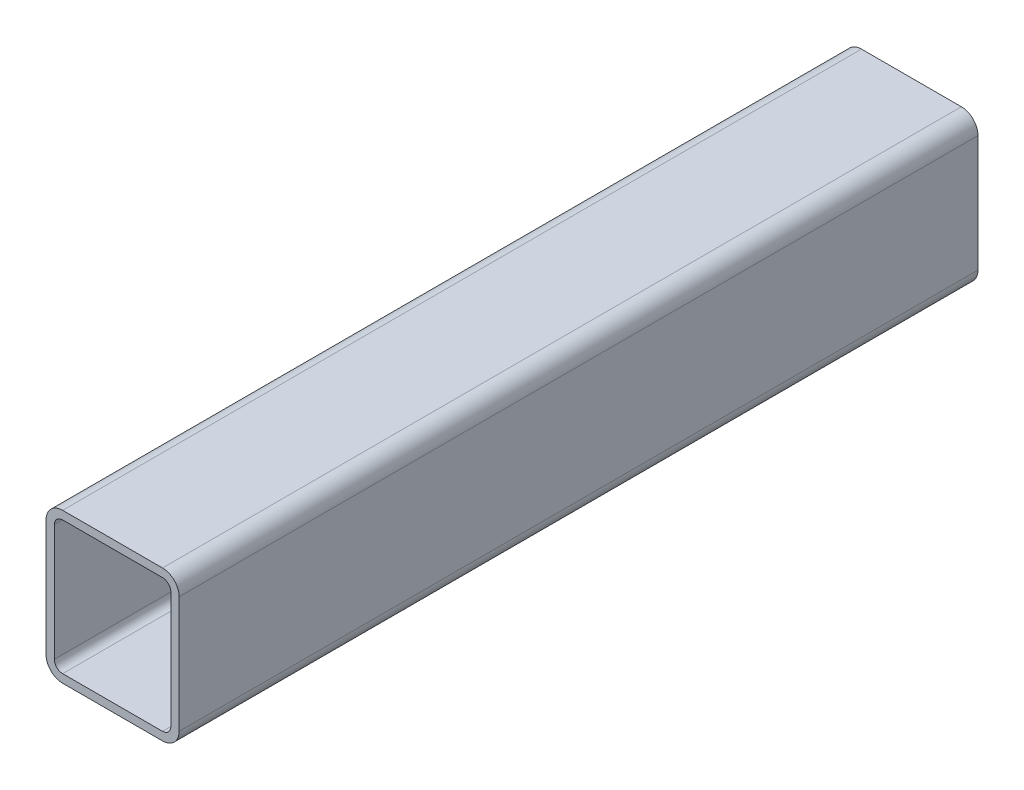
ISO-10303-21;
HEADER;
FILE_DESCRIPTION(('STEP AP214'),'2;1');
FILE_NAME('part.step','',(''),(''),'','','');
FILE_SCHEMA(('AUTOMOTIVE_DESIGN { 1 0 10303 214 1 1 1 1 }'));
ENDSEC;
DATA;
#1=APPLICATION_CONTEXT('core data for automotive mechanical design processes');
#2=APPLICATION_PROTOCOL_DEFINITION('international standard','automotive_design',2000,#1);
#3=PRODUCT_CONTEXT('',#1,'mechanical');
#4=PRODUCT('Part','Part','',(#3));
#5=PRODUCT_RELATED_PRODUCT_CATEGORY('part','',(#4));
#6=PRODUCT_DEFINITION_FORMATION('','',#4);
#7=PRODUCT_DEFINITION_CONTEXT('part definition',#1,'design');
#8=PRODUCT_DEFINITION('design','',#6,#7);
#9=PRODUCT_DEFINITION_SHAPE('','',#8);
#10=(LENGTH_UNIT() NAMED_UNIT(*) SI_UNIT(.MILLI.,.METRE.));
#11=(NAMED_UNIT(*) PLANE_ANGLE_UNIT() SI_UNIT($,.RADIAN.));
#12=(NAMED_UNIT(*) SI_UNIT($,.STERADIAN.) SOLID_ANGLE_UNIT());
#13=UNCERTAINTY_MEASURE_WITH_UNIT(LENGTH_MEASURE(1.E-05),#10,'distance_accuracy_value','');
#14=(GEOMETRIC_REPRESENTATION_CONTEXT(3) GLOBAL_UNCERTAINTY_ASSIGNED_CONTEXT((#13)) GLOBAL_UNIT_ASSIGNED_CONTEXT((#10,
#11,#12)) REPRESENTATION_CONTEXT('',''));
#15=CARTESIAN_POINT('',(0.,0.,0.));
#16=DIRECTION('',(0.,0.,1.));
#17=DIRECTION('',(1.,0.,0.));
#18=AXIS2_PLACEMENT_3D('',#15,#16,#17);
#19=CARTESIAN_POINT('',(6.35,50.8,304.8));
#20=DIRECTION('',(0.,0.,1.));
#21=DIRECTION('',(1.,0.,0.));
#22=AXIS2_PLACEMENT_3D('',#19,#20,#21);
#23=PLANE('',#22);
#24=CARTESIAN_POINT('',(6.35,50.8,304.8));
#25=DIRECTION('',(0.,0.,1.));
#26=DIRECTION('',(1.,0.,0.));
#27=AXIS2_PLACEMENT_3D('',#24,#25,#26);
#28=CIRCLE('',#27,6.35);
#29=CARTESIAN_POINT('',(6.35,57.15,304.8));
#30=VERTEX_POINT('',#29);
#31=CARTESIAN_POINT('',(0.,50.8,304.8));
#32=VERTEX_POINT('',#31);
#33=EDGE_CURVE('E211',#30,#32,#28,.T.);
#34=ORIENTED_EDGE('',*,*,#33,.T.);
#35=DIRECTION('',(0.,-1.,0.));
#36=VECTOR('',#35,1.);
#37=CARTESIAN_POINT('',(0.,6.35,304.8));
#38=LINE('',#37,#36);
#39=CARTESIAN_POINT('',(0.,6.35,304.8));
#40=VERTEX_POINT('',#39);
#41=EDGE_CURVE('E214',#32,#40,#38,.T.);
#42=ORIENTED_EDGE('',*,*,#41,.T.);
#43=CARTESIAN_POINT('',(6.35,6.35,304.8));
#44=DIRECTION('',(0.,0.,1.));
#45=DIRECTION('',(1.,0.,0.));
#46=AXIS2_PLACEMENT_3D('',#43,#44,#45);
#47=CIRCLE('',#46,6.35);
#48=CARTESIAN_POINT('',(6.35,0.,304.8));
#49=VERTEX_POINT('',#48);
#50=EDGE_CURVE('E217',#40,#49,#47,.T.);
#51=ORIENTED_EDGE('',*,*,#50,.T.);
#52=DIRECTION('',(1.,0.,0.));
#53=VECTOR('',#52,1.);
#54=CARTESIAN_POINT('',(44.4499999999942,0.,304.8));
#55=LINE('',#54,#53);
#56=CARTESIAN_POINT('',(44.4499999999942,0.,304.8));
#57=VERTEX_POINT('',#56);
#58=EDGE_CURVE('E219',#49,#57,#55,.T.);
#59=ORIENTED_EDGE('',*,*,#58,.T.);
#60=CARTESIAN_POINT('',(44.4499999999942,6.35,304.8));
#61=DIRECTION('',(0.,0.,1.));
#62=DIRECTION('',(1.,0.,0.));
#63=AXIS2_PLACEMENT_3D('',#60,#61,#62);
#64=CIRCLE('',#63,6.35);
#65=CARTESIAN_POINT('',(50.7999999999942,6.35,304.8));
#66=VERTEX_POINT('',#65);
#67=EDGE_CURVE('E221',#57,#66,#64,.T.);
#68=ORIENTED_EDGE('',*,*,#67,.T.);
#69=DIRECTION('',(0.,1.,0.));
#70=VECTOR('',#69,1.);
#71=CARTESIAN_POINT('',(50.7999999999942,50.8,304.8));
#72=LINE('',#71,#70);
#73=CARTESIAN_POINT('',(50.7999999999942,50.8,304.8));
#74=VERTEX_POINT('',#73);
#75=EDGE_CURVE('E223',#66,#74,#72,.T.);
#76=ORIENTED_EDGE('',*,*,#75,.T.);
#77=CARTESIAN_POINT('',(44.4499999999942,50.8,304.8));
#78=DIRECTION('',(0.,0.,1.));
#79=DIRECTION('',(1.,0.,0.));
#80=AXIS2_PLACEMENT_3D('',#77,#78,#79);
#81=CIRCLE('',#80,6.35);
#82=CARTESIAN_POINT('',(44.4499999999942,57.15,304.8));
#83=VERTEX_POINT('',#82);
#84=EDGE_CURVE('E225',#74,#83,#81,.T.);
#85=ORIENTED_EDGE('',*,*,#84,.T.);
#86=DIRECTION('',(-1.,0.,0.));
#87=VECTOR('',#86,1.);
#88=CARTESIAN_POINT('',(6.35,57.15,304.8));
#89=LINE('',#88,#87);
#90=EDGE_CURVE('E227',#83,#30,#89,.T.);
#91=ORIENTED_EDGE('',*,*,#90,.T.);
#92=EDGE_LOOP('',(#34,#42,#51,#59,#68,#76,#85,#91));
#93=FACE_BOUND('',#92,.T.);
#94=DIRECTION('',(0.,-1.,0.));
#95=VECTOR('',#94,1.);
#96=CARTESIAN_POINT('',(3.175,6.35,304.8));
#97=LINE('',#96,#95);
#98=CARTESIAN_POINT('',(3.175,50.8,304.8));
#99=VERTEX_POINT('',#98);
#100=CARTESIAN_POINT('',(3.175,6.35,304.8));
#101=VERTEX_POINT('',#100);
#102=EDGE_CURVE('E154',#99,#101,#97,.T.);
#103=ORIENTED_EDGE('',*,*,#102,.F.);
#104=CARTESIAN_POINT('',(6.35,50.8,304.8));
#105=DIRECTION('',(0.,0.,1.));
#106=DIRECTION('',(1.,0.,0.));
#107=AXIS2_PLACEMENT_3D('',#104,#105,#106);
#108=CIRCLE('',#107,3.175);
#109=CARTESIAN_POINT('',(6.35,53.975,304.8));
#110=VERTEX_POINT('',#109);
#111=EDGE_CURVE('E146',#110,#99,#108,.T.);
#112=ORIENTED_EDGE('',*,*,#111,.F.);
#113=DIRECTION('',(-1.,0.,0.));
#114=VECTOR('',#113,1.);
#115=CARTESIAN_POINT('',(6.35,53.975,304.8));
#116=LINE('',#115,#114);
#117=CARTESIAN_POINT('',(44.4499999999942,53.975,304.8));
#118=VERTEX_POINT('',#117);
#119=EDGE_CURVE('E179',#118,#110,#116,.T.);
#120=ORIENTED_EDGE('',*,*,#119,.F.);
#121=CARTESIAN_POINT('',(44.4499999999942,50.8,304.8));
#122=DIRECTION('',(0.,0.,1.));
#123=DIRECTION('',(1.,0.,0.));
#124=AXIS2_PLACEMENT_3D('',#121,#122,#123);
#125=CIRCLE('',#124,3.175);
#126=CARTESIAN_POINT('',(47.6249999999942,50.8,304.8));
#127=VERTEX_POINT('',#126);
#128=EDGE_CURVE('E177',#127,#118,#125,.T.);
#129=ORIENTED_EDGE('',*,*,#128,.F.);
#130=DIRECTION('',(0.,1.,0.));
#131=VECTOR('',#130,1.);
#132=CARTESIAN_POINT('',(47.6249999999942,50.8,304.8));
#133=LINE('',#132,#131);
#134=CARTESIAN_POINT('',(47.6249999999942,6.35,304.8));
#135=VERTEX_POINT('',#134);
#136=EDGE_CURVE('E175',#135,#127,#133,.T.);
#137=ORIENTED_EDGE('',*,*,#136,.F.);
#138=CARTESIAN_POINT('',(44.4499999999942,6.35,304.8));
#139=DIRECTION('',(0.,0.,1.));
#140=DIRECTION('',(1.,0.,0.));
#141=AXIS2_PLACEMENT_3D('',#138,#139,#140);
#142=CIRCLE('',#141,3.175);
#143=CARTESIAN_POINT('',(44.4499999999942,3.175,304.8));
#144=VERTEX_POINT('',#143);
#145=EDGE_CURVE('E173',#144,#135,#142,.T.);
#146=ORIENTED_EDGE('',*,*,#145,.F.);
#147=DIRECTION('',(1.,0.,0.));
#148=VECTOR('',#147,1.);
#149=CARTESIAN_POINT('',(44.4499999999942,3.175,304.8));
#150=LINE('',#149,#148);
#151=CARTESIAN_POINT('',(6.35,3.175,304.8));
#152=VERTEX_POINT('',#151);
#153=EDGE_CURVE('E169',#152,#144,#150,.T.);
#154=ORIENTED_EDGE('',*,*,#153,.F.);
#155=CARTESIAN_POINT('',(6.35,6.35,304.8));
#156=DIRECTION('',(0.,0.,1.));
#157=DIRECTION('',(1.,0.,0.));
#158=AXIS2_PLACEMENT_3D('',#155,#156,#157);
#159=CIRCLE('',#158,3.175);
#160=EDGE_CURVE('E167',#101,#152,#159,.T.);
#161=ORIENTED_EDGE('',*,*,#160,.F.);
#162=EDGE_LOOP('',(#103,#112,#120,#129,#137,#146,#154,#161));
#163=FACE_BOUND('',#162,.T.);
#164=ADVANCED_FACE('F33',(#93,#163),#23,.T.);
#165=CARTESIAN_POINT('',(6.35,50.8,0.));
#166=DIRECTION('',(0.,0.,1.));
#167=DIRECTION('',(1.,0.,0.));
#168=AXIS2_PLACEMENT_3D('',#165,#166,#167);
#169=PLANE('',#168);
#170=CARTESIAN_POINT('',(6.35,50.8,0.));
#171=DIRECTION('',(0.,0.,1.));
#172=DIRECTION('',(1.,0.,0.));
#173=AXIS2_PLACEMENT_3D('',#170,#171,#172);
#174=CIRCLE('',#173,6.35);
#175=CARTESIAN_POINT('',(6.35,57.15,0.));
#176=VERTEX_POINT('',#175);
#177=CARTESIAN_POINT('',(0.,50.8,0.));
#178=VERTEX_POINT('',#177);
#179=EDGE_CURVE('E162',#176,#178,#174,.T.);
#180=ORIENTED_EDGE('',*,*,#179,.F.);
#181=DIRECTION('',(-1.,0.,0.));
#182=VECTOR('',#181,1.);
#183=CARTESIAN_POINT('',(6.35,57.15,0.));
#184=LINE('',#183,#182);
#185=CARTESIAN_POINT('',(44.4499999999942,57.15,0.));
#186=VERTEX_POINT('',#185);
#187=EDGE_CURVE('E215',#186,#176,#184,.T.);
#188=ORIENTED_EDGE('',*,*,#187,.F.);
#189=CARTESIAN_POINT('',(44.4499999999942,50.8,0.));
#190=DIRECTION('',(0.,0.,1.));
#191=DIRECTION('',(1.,0.,0.));
#192=AXIS2_PLACEMENT_3D('',#189,#190,#191);
#193=CIRCLE('',#192,6.35);
#194=CARTESIAN_POINT('',(50.7999999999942,50.8,0.));
#195=VERTEX_POINT('',#194);
#196=EDGE_CURVE('E242',#195,#186,#193,.T.);
#197=ORIENTED_EDGE('',*,*,#196,.F.);
#198=DIRECTION('',(0.,1.,0.));
#199=VECTOR('',#198,1.);
#200=CARTESIAN_POINT('',(50.7999999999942,50.8,0.));
#201=LINE('',#200,#199);
#202=CARTESIAN_POINT('',(50.7999999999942,6.35,0.));
#203=VERTEX_POINT('',#202);
#204=EDGE_CURVE('E240',#203,#195,#201,.T.);
#205=ORIENTED_EDGE('',*,*,#204,.F.);
#206=CARTESIAN_POINT('',(44.4499999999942,6.35,0.));
#207=DIRECTION('',(0.,0.,1.));
#208=DIRECTION('',(1.,0.,0.));
#209=AXIS2_PLACEMENT_3D('',#206,#207,#208);
#210=CIRCLE('',#209,6.35);
#211=CARTESIAN_POINT('',(44.4499999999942,0.,0.));
#212=VERTEX_POINT('',#211);
#213=EDGE_CURVE('E238',#212,#203,#210,.T.);
#214=ORIENTED_EDGE('',*,*,#213,.F.);
#215=DIRECTION('',(1.,0.,0.));
#216=VECTOR('',#215,1.);
#217=CARTESIAN_POINT('',(44.4499999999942,0.,0.));
#218=LINE('',#217,#216);
#219=CARTESIAN_POINT('',(6.35,0.,0.));
#220=VERTEX_POINT('',#219);
#221=EDGE_CURVE('E236',#220,#212,#218,.T.);
#222=ORIENTED_EDGE('',*,*,#221,.F.);
#223=CARTESIAN_POINT('',(6.35,6.35,0.));
#224=DIRECTION('',(0.,0.,1.));
#225=DIRECTION('',(1.,0.,0.));
#226=AXIS2_PLACEMENT_3D('',#223,#224,#225);
#227=CIRCLE('',#226,6.35);
#228=CARTESIAN_POINT('',(0.,6.35,0.));
#229=VERTEX_POINT('',#228);
#230=EDGE_CURVE('E234',#229,#220,#227,.T.);
#231=ORIENTED_EDGE('',*,*,#230,.F.);
#232=DIRECTION('',(0.,-1.,0.));
#233=VECTOR('',#232,1.);
#234=CARTESIAN_POINT('',(0.,6.35,0.));
#235=LINE('',#234,#233);
#236=EDGE_CURVE('E232',#178,#229,#235,.T.);
#237=ORIENTED_EDGE('',*,*,#236,.F.);
#238=EDGE_LOOP('',(#180,#188,#197,#205,#214,#222,#231,#237));
#239=FACE_BOUND('',#238,.T.);
#240=CARTESIAN_POINT('',(6.35,50.8,0.));
#241=DIRECTION('',(0.,0.,1.));
#242=DIRECTION('',(1.,0.,0.));
#243=AXIS2_PLACEMENT_3D('',#240,#241,#242);
#244=CIRCLE('',#243,3.175);
#245=CARTESIAN_POINT('',(6.35,53.975,0.));
#246=VERTEX_POINT('',#245);
#247=CARTESIAN_POINT('',(3.175,50.8,0.));
#248=VERTEX_POINT('',#247);
#249=EDGE_CURVE('E56',#246,#248,#244,.T.);
#250=ORIENTED_EDGE('',*,*,#249,.T.);
#251=DIRECTION('',(0.,-1.,0.));
#252=VECTOR('',#251,1.);
#253=CARTESIAN_POINT('',(3.175,6.35,0.));
#254=LINE('',#253,#252);
#255=CARTESIAN_POINT('',(3.175,6.35,0.));
#256=VERTEX_POINT('',#255);
#257=EDGE_CURVE('E161',#248,#256,#254,.T.);
#258=ORIENTED_EDGE('',*,*,#257,.T.);
#259=CARTESIAN_POINT('',(6.35,6.35,0.));
#260=DIRECTION('',(0.,0.,1.));
#261=DIRECTION('',(1.,0.,0.));
#262=AXIS2_PLACEMENT_3D('',#259,#260,#261);
#263=CIRCLE('',#262,3.175);
#264=CARTESIAN_POINT('',(6.35,3.175,0.));
#265=VERTEX_POINT('',#264);
#266=EDGE_CURVE('E183',#256,#265,#263,.T.);
#267=ORIENTED_EDGE('',*,*,#266,.T.);
#268=DIRECTION('',(1.,0.,0.));
#269=VECTOR('',#268,1.);
#270=CARTESIAN_POINT('',(44.4499999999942,3.175,0.));
#271=LINE('',#270,#269);
#272=CARTESIAN_POINT('',(44.4499999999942,3.175,0.));
#273=VERTEX_POINT('',#272);
#274=EDGE_CURVE('E186',#265,#273,#271,.T.);
#275=ORIENTED_EDGE('',*,*,#274,.T.);
#276=CARTESIAN_POINT('',(44.4499999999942,6.35,0.));
#277=DIRECTION('',(0.,0.,1.));
#278=DIRECTION('',(1.,0.,0.));
#279=AXIS2_PLACEMENT_3D('',#276,#277,#278);
#280=CIRCLE('',#279,3.175);
#281=CARTESIAN_POINT('',(47.6249999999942,6.35,0.));
#282=VERTEX_POINT('',#281);
#283=EDGE_CURVE('E189',#273,#282,#280,.T.);
#284=ORIENTED_EDGE('',*,*,#283,.T.);
#285=DIRECTION('',(0.,1.,0.));
#286=VECTOR('',#285,1.);
#287=CARTESIAN_POINT('',(47.6249999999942,50.8,0.));
#288=LINE('',#287,#286);
#289=CARTESIAN_POINT('',(47.6249999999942,50.8,0.));
#290=VERTEX_POINT('',#289);
#291=EDGE_CURVE('E192',#282,#290,#288,.T.);
#292=ORIENTED_EDGE('',*,*,#291,.T.);
#293=CARTESIAN_POINT('',(44.4499999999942,50.8,0.));
#294=DIRECTION('',(0.,0.,1.));
#295=DIRECTION('',(1.,0.,0.));
#296=AXIS2_PLACEMENT_3D('',#293,#294,#295);
#297=CIRCLE('',#296,3.175);
#298=CARTESIAN_POINT('',(44.4499999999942,53.975,0.));
#299=VERTEX_POINT('',#298);
#300=EDGE_CURVE('E195',#290,#299,#297,.T.);
#301=ORIENTED_EDGE('',*,*,#300,.T.);
#302=DIRECTION('',(-1.,0.,0.));
#303=VECTOR('',#302,1.);
#304=CARTESIAN_POINT('',(6.35,53.975,0.));
#305=LINE('',#304,#303);
#306=EDGE_CURVE('E155',#299,#246,#305,.T.);
#307=ORIENTED_EDGE('',*,*,#306,.T.);
#308=EDGE_LOOP('',(#250,#258,#267,#275,#284,#292,#301,#307));
#309=FACE_BOUND('',#308,.T.);
#310=ADVANCED_FACE('F272',(#239,#309),#169,.F.);
#311=CARTESIAN_POINT('',(6.35,50.8,304.8));
#312=DIRECTION('',(0.,0.,-1.));
#313=DIRECTION('',(-1.,0.,0.));
#314=AXIS2_PLACEMENT_3D('',#311,#312,#313);
#315=CYLINDRICAL_SURFACE('',#314,6.35);
#316=ORIENTED_EDGE('',*,*,#179,.T.);
#317=DIRECTION('',(0.,0.,-1.));
#318=VECTOR('',#317,1.);
#319=CARTESIAN_POINT('',(0.,50.8,304.8));
#320=LINE('',#319,#318);
#321=EDGE_CURVE('E11',#32,#178,#320,.T.);
#322=ORIENTED_EDGE('',*,*,#321,.F.);
#323=ORIENTED_EDGE('',*,*,#33,.F.);
#324=DIRECTION('',(0.,0.,-1.));
#325=VECTOR('',#324,1.);
#326=CARTESIAN_POINT('',(6.35,57.15,304.8));
#327=LINE('',#326,#325);
#328=EDGE_CURVE('E229',#30,#176,#327,.T.);
#329=ORIENTED_EDGE('',*,*,#328,.T.);
#330=EDGE_LOOP('',(#316,#322,#323,#329));
#331=FACE_BOUND('',#330,.T.);
#332=ADVANCED_FACE('F35',(#331),#315,.T.);
#333=CARTESIAN_POINT('',(0.,6.35,304.8));
#334=DIRECTION('',(1.,0.,0.));
#335=DIRECTION('',(0.,0.,-1.));
#336=AXIS2_PLACEMENT_3D('',#333,#334,#335);
#337=PLANE('',#336);
#338=ORIENTED_EDGE('',*,*,#236,.T.);
#339=DIRECTION('',(0.,0.,-1.));
#340=VECTOR('',#339,1.);
#341=CARTESIAN_POINT('',(0.,6.35,304.8));
#342=LINE('',#341,#340);
#343=EDGE_CURVE('E41',#40,#229,#342,.T.);
#344=ORIENTED_EDGE('',*,*,#343,.F.);
#345=ORIENTED_EDGE('',*,*,#41,.F.);
#346=ORIENTED_EDGE('',*,*,#321,.T.);
#347=EDGE_LOOP('',(#338,#344,#345,#346));
#348=FACE_BOUND('',#347,.T.);
#349=ADVANCED_FACE('F289',(#348),#337,.F.);
#350=CARTESIAN_POINT('',(6.35,6.35,304.8));
#351=DIRECTION('',(0.,0.,-1.));
#352=DIRECTION('',(-1.,0.,0.));
#353=AXIS2_PLACEMENT_3D('',#350,#351,#352);
#354=CYLINDRICAL_SURFACE('',#353,6.35);
#355=ORIENTED_EDGE('',*,*,#230,.T.);
#356=DIRECTION('',(0.,0.,-1.));
#357=VECTOR('',#356,1.);
#358=CARTESIAN_POINT('',(6.35,0.,304.8));
#359=LINE('',#358,#357);
#360=EDGE_CURVE('E259',#49,#220,#359,.T.);
#361=ORIENTED_EDGE('',*,*,#360,.F.);
#362=ORIENTED_EDGE('',*,*,#50,.F.);
#363=ORIENTED_EDGE('',*,*,#343,.T.);
#364=EDGE_LOOP('',(#355,#361,#362,#363));
#365=FACE_BOUND('',#364,.T.);
#366=ADVANCED_FACE('F266',(#365),#354,.T.);
#367=CARTESIAN_POINT('',(44.4499999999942,0.,304.8));
#368=DIRECTION('',(0.,1.,0.));
#369=DIRECTION('',(0.,0.,1.));
#370=AXIS2_PLACEMENT_3D('',#367,#368,#369);
#371=PLANE('',#370);
#372=ORIENTED_EDGE('',*,*,#221,.T.);
#373=DIRECTION('',(0.,0.,-1.));
#374=VECTOR('',#373,1.);
#375=CARTESIAN_POINT('',(44.4499999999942,0.,304.8));
#376=LINE('',#375,#374);
#377=EDGE_CURVE('E256',#57,#212,#376,.T.);
#378=ORIENTED_EDGE('',*,*,#377,.F.);
#379=ORIENTED_EDGE('',*,*,#58,.F.);
#380=ORIENTED_EDGE('',*,*,#360,.T.);
#381=EDGE_LOOP('',(#372,#378,#379,#380));
#382=FACE_BOUND('',#381,.T.);
#383=ADVANCED_FACE('F278',(#382),#371,.F.);
#384=CARTESIAN_POINT('',(44.4499999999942,6.35,304.8));
#385=DIRECTION('',(0.,0.,-1.));
#386=DIRECTION('',(-1.,0.,0.));
#387=AXIS2_PLACEMENT_3D('',#384,#385,#386);
#388=CYLINDRICAL_SURFACE('',#387,6.35);
#389=ORIENTED_EDGE('',*,*,#213,.T.);
#390=DIRECTION('',(0.,0.,-1.));
#391=VECTOR('',#390,1.);
#392=CARTESIAN_POINT('',(50.7999999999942,6.35,304.8));
#393=LINE('',#392,#391);
#394=EDGE_CURVE('E253',#66,#203,#393,.T.);
#395=ORIENTED_EDGE('',*,*,#394,.F.);
#396=ORIENTED_EDGE('',*,*,#67,.F.);
#397=ORIENTED_EDGE('',*,*,#377,.T.);
#398=EDGE_LOOP('',(#389,#395,#396,#397));
#399=FACE_BOUND('',#398,.T.);
#400=ADVANCED_FACE('F282',(#399),#388,.T.);
#401=CARTESIAN_POINT('',(50.7999999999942,50.8,304.8));
#402=DIRECTION('',(-1.,0.,0.));
#403=DIRECTION('',(0.,0.,1.));
#404=AXIS2_PLACEMENT_3D('',#401,#402,#403);
#405=PLANE('',#404);
#406=ORIENTED_EDGE('',*,*,#204,.T.);
#407=DIRECTION('',(0.,0.,-1.));
#408=VECTOR('',#407,1.);
#409=CARTESIAN_POINT('',(50.7999999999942,50.8,304.8));
#410=LINE('',#409,#408);
#411=EDGE_CURVE('E250',#74,#195,#410,.T.);
#412=ORIENTED_EDGE('',*,*,#411,.F.);
#413=ORIENTED_EDGE('',*,*,#75,.F.);
#414=ORIENTED_EDGE('',*,*,#394,.T.);
#415=EDGE_LOOP('',(#406,#412,#413,#414));
#416=FACE_BOUND('',#415,.T.);
#417=ADVANCED_FACE('F302',(#416),#405,.F.);
#418=CARTESIAN_POINT('',(44.4499999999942,50.8,304.8));
#419=DIRECTION('',(0.,0.,-1.));
#420=DIRECTION('',(-1.,0.,0.));
#421=AXIS2_PLACEMENT_3D('',#418,#419,#420);
#422=CYLINDRICAL_SURFACE('',#421,6.35);
#423=ORIENTED_EDGE('',*,*,#196,.T.);
#424=DIRECTION('',(0.,0.,-1.));
#425=VECTOR('',#424,1.);
#426=CARTESIAN_POINT('',(44.4499999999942,57.15,304.8));
#427=LINE('',#426,#425);
#428=EDGE_CURVE('E247',#83,#186,#427,.T.);
#429=ORIENTED_EDGE('',*,*,#428,.F.);
#430=ORIENTED_EDGE('',*,*,#84,.F.);
#431=ORIENTED_EDGE('',*,*,#411,.T.);
#432=EDGE_LOOP('',(#423,#429,#430,#431));
#433=FACE_BOUND('',#432,.T.);
#434=ADVANCED_FACE('F300',(#433),#422,.T.);
#435=CARTESIAN_POINT('',(6.35,57.15,304.8));
#436=DIRECTION('',(0.,-1.,0.));
#437=DIRECTION('',(0.,0.,-1.));
#438=AXIS2_PLACEMENT_3D('',#435,#436,#437);
#439=PLANE('',#438);
#440=ORIENTED_EDGE('',*,*,#187,.T.);
#441=ORIENTED_EDGE('',*,*,#328,.F.);
#442=ORIENTED_EDGE('',*,*,#90,.F.);
#443=ORIENTED_EDGE('',*,*,#428,.T.);
#444=EDGE_LOOP('',(#440,#441,#442,#443));
#445=FACE_BOUND('',#444,.T.);
#446=ADVANCED_FACE('F295',(#445),#439,.F.);
#447=CARTESIAN_POINT('',(6.35,50.8,304.8));
#448=DIRECTION('',(0.,0.,-1.));
#449=DIRECTION('',(-1.,0.,0.));
#450=AXIS2_PLACEMENT_3D('',#447,#448,#449);
#451=CYLINDRICAL_SURFACE('',#450,3.175);
#452=ORIENTED_EDGE('',*,*,#249,.F.);
#453=DIRECTION('',(0.,0.,-1.));
#454=VECTOR('',#453,1.);
#455=CARTESIAN_POINT('',(6.35,53.975,304.8));
#456=LINE('',#455,#454);
#457=EDGE_CURVE('E150',#110,#246,#456,.T.);
#458=ORIENTED_EDGE('',*,*,#457,.F.);
#459=ORIENTED_EDGE('',*,*,#111,.T.);
#460=DIRECTION('',(0.,0.,-1.));
#461=VECTOR('',#460,1.);
#462=CARTESIAN_POINT('',(3.175,50.8,304.8));
#463=LINE('',#462,#461);
#464=EDGE_CURVE('E149',#99,#248,#463,.T.);
#465=ORIENTED_EDGE('',*,*,#464,.T.);
#466=EDGE_LOOP('',(#452,#458,#459,#465));
#467=FACE_BOUND('',#466,.T.);
#468=ADVANCED_FACE('F148',(#467),#451,.F.);
#469=CARTESIAN_POINT('',(3.175,6.35,304.8));
#470=DIRECTION('',(1.,0.,0.));
#471=DIRECTION('',(0.,0.,-1.));
#472=AXIS2_PLACEMENT_3D('',#469,#470,#471);
#473=PLANE('',#472);
#474=ORIENTED_EDGE('',*,*,#257,.F.);
#475=ORIENTED_EDGE('',*,*,#464,.F.);
#476=ORIENTED_EDGE('',*,*,#102,.T.);
#477=DIRECTION('',(0.,0.,-1.));
#478=VECTOR('',#477,1.);
#479=CARTESIAN_POINT('',(3.175,6.35,304.8));
#480=LINE('',#479,#478);
#481=EDGE_CURVE('E163',#101,#256,#480,.T.);
#482=ORIENTED_EDGE('',*,*,#481,.T.);
#483=EDGE_LOOP('',(#474,#475,#476,#482));
#484=FACE_BOUND('',#483,.T.);
#485=ADVANCED_FACE('F158',(#484),#473,.T.);
#486=CARTESIAN_POINT('',(6.35,6.35,304.8));
#487=DIRECTION('',(0.,0.,-1.));
#488=DIRECTION('',(-1.,0.,0.));
#489=AXIS2_PLACEMENT_3D('',#486,#487,#488);
#490=CYLINDRICAL_SURFACE('',#489,3.175);
#491=ORIENTED_EDGE('',*,*,#266,.F.);
#492=ORIENTED_EDGE('',*,*,#481,.F.);
#493=ORIENTED_EDGE('',*,*,#160,.T.);
#494=DIRECTION('',(0.,0.,-1.));
#495=VECTOR('',#494,1.);
#496=CARTESIAN_POINT('',(6.35,3.175,304.8));
#497=LINE('',#496,#495);
#498=EDGE_CURVE('E208',#152,#265,#497,.T.);
#499=ORIENTED_EDGE('',*,*,#498,.T.);
#500=EDGE_LOOP('',(#491,#492,#493,#499));
#501=FACE_BOUND('',#500,.T.);
#502=ADVANCED_FACE('F327',(#501),#490,.F.);
#503=CARTESIAN_POINT('',(44.4499999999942,3.175,304.8));
#504=DIRECTION('',(0.,1.,0.));
#505=DIRECTION('',(0.,0.,1.));
#506=AXIS2_PLACEMENT_3D('',#503,#504,#505);
#507=PLANE('',#506);
#508=ORIENTED_EDGE('',*,*,#274,.F.);
#509=ORIENTED_EDGE('',*,*,#498,.F.);
#510=ORIENTED_EDGE('',*,*,#153,.T.);
#511=DIRECTION('',(0.,0.,-1.));
#512=VECTOR('',#511,1.);
#513=CARTESIAN_POINT('',(44.4499999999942,3.175,304.8));
#514=LINE('',#513,#512);
#515=EDGE_CURVE('E206',#144,#273,#514,.T.);
#516=ORIENTED_EDGE('',*,*,#515,.T.);
#517=EDGE_LOOP('',(#508,#509,#510,#516));
#518=FACE_BOUND('',#517,.T.);
#519=ADVANCED_FACE('F331',(#518),#507,.T.);
#520=CARTESIAN_POINT('',(44.4499999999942,6.35,304.8));
#521=DIRECTION('',(0.,0.,-1.));
#522=DIRECTION('',(-1.,0.,0.));
#523=AXIS2_PLACEMENT_3D('',#520,#521,#522);
#524=CYLINDRICAL_SURFACE('',#523,3.175);
#525=ORIENTED_EDGE('',*,*,#283,.F.);
#526=ORIENTED_EDGE('',*,*,#515,.F.);
#527=ORIENTED_EDGE('',*,*,#145,.T.);
#528=DIRECTION('',(0.,0.,-1.));
#529=VECTOR('',#528,1.);
#530=CARTESIAN_POINT('',(47.6249999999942,6.35,304.8));
#531=LINE('',#530,#529);
#532=EDGE_CURVE('E204',#135,#282,#531,.T.);
#533=ORIENTED_EDGE('',*,*,#532,.T.);
#534=EDGE_LOOP('',(#525,#526,#527,#533));
#535=FACE_BOUND('',#534,.T.);
#536=ADVANCED_FACE('F337',(#535),#524,.F.);
#537=CARTESIAN_POINT('',(47.6249999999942,50.8,304.8));
#538=DIRECTION('',(-1.,0.,0.));
#539=DIRECTION('',(0.,0.,1.));
#540=AXIS2_PLACEMENT_3D('',#537,#538,#539);
#541=PLANE('',#540);
#542=ORIENTED_EDGE('',*,*,#291,.F.);
#543=ORIENTED_EDGE('',*,*,#532,.F.);
#544=ORIENTED_EDGE('',*,*,#136,.T.);
#545=DIRECTION('',(0.,0.,-1.));
#546=VECTOR('',#545,1.);
#547=CARTESIAN_POINT('',(47.6249999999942,50.8,304.8));
#548=LINE('',#547,#546);
#549=EDGE_CURVE('E202',#127,#290,#548,.T.);
#550=ORIENTED_EDGE('',*,*,#549,.T.);
#551=EDGE_LOOP('',(#542,#543,#544,#550));
#552=FACE_BOUND('',#551,.T.);
#553=ADVANCED_FACE('F341',(#552),#541,.T.);
#554=CARTESIAN_POINT('',(44.4499999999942,50.8,304.8));
#555=DIRECTION('',(0.,0.,-1.));
#556=DIRECTION('',(-1.,0.,0.));
#557=AXIS2_PLACEMENT_3D('',#554,#555,#556);
#558=CYLINDRICAL_SURFACE('',#557,3.175);
#559=ORIENTED_EDGE('',*,*,#300,.F.);
#560=ORIENTED_EDGE('',*,*,#549,.F.);
#561=ORIENTED_EDGE('',*,*,#128,.T.);
#562=DIRECTION('',(0.,0.,-1.));
#563=VECTOR('',#562,1.);
#564=CARTESIAN_POINT('',(44.4499999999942,53.975,304.8));
#565=LINE('',#564,#563);
#566=EDGE_CURVE('E48',#118,#299,#565,.T.);
#567=ORIENTED_EDGE('',*,*,#566,.T.);
#568=EDGE_LOOP('',(#559,#560,#561,#567));
#569=FACE_BOUND('',#568,.T.);
#570=ADVANCED_FACE('F345',(#569),#558,.F.);
#571=CARTESIAN_POINT('',(6.35,53.975,304.8));
#572=DIRECTION('',(0.,-1.,0.));
#573=DIRECTION('',(0.,0.,-1.));
#574=AXIS2_PLACEMENT_3D('',#571,#572,#573);
#575=PLANE('',#574);
#576=ORIENTED_EDGE('',*,*,#306,.F.);
#577=ORIENTED_EDGE('',*,*,#566,.F.);
#578=ORIENTED_EDGE('',*,*,#119,.T.);
#579=ORIENTED_EDGE('',*,*,#457,.T.);
#580=EDGE_LOOP('',(#576,#577,#578,#579));
#581=FACE_BOUND('',#580,.T.);
#582=ADVANCED_FACE('F349',(#581),#575,.T.);
#583=CLOSED_SHELL('',(#164,#310,#332,#349,#366,#383,#400,#417,#434,#446,#468,#485,#502,#519,
#536,#553,#570,#582));
#584=MANIFOLD_SOLID_BREP('B2',#583);
#585=ADVANCED_BREP_SHAPE_REPRESENTATION('',(#18,#584),#14);
#586=SHAPE_DEFINITION_REPRESENTATION(#9,#585);
ENDSEC;
END-ISO-10303-21;
